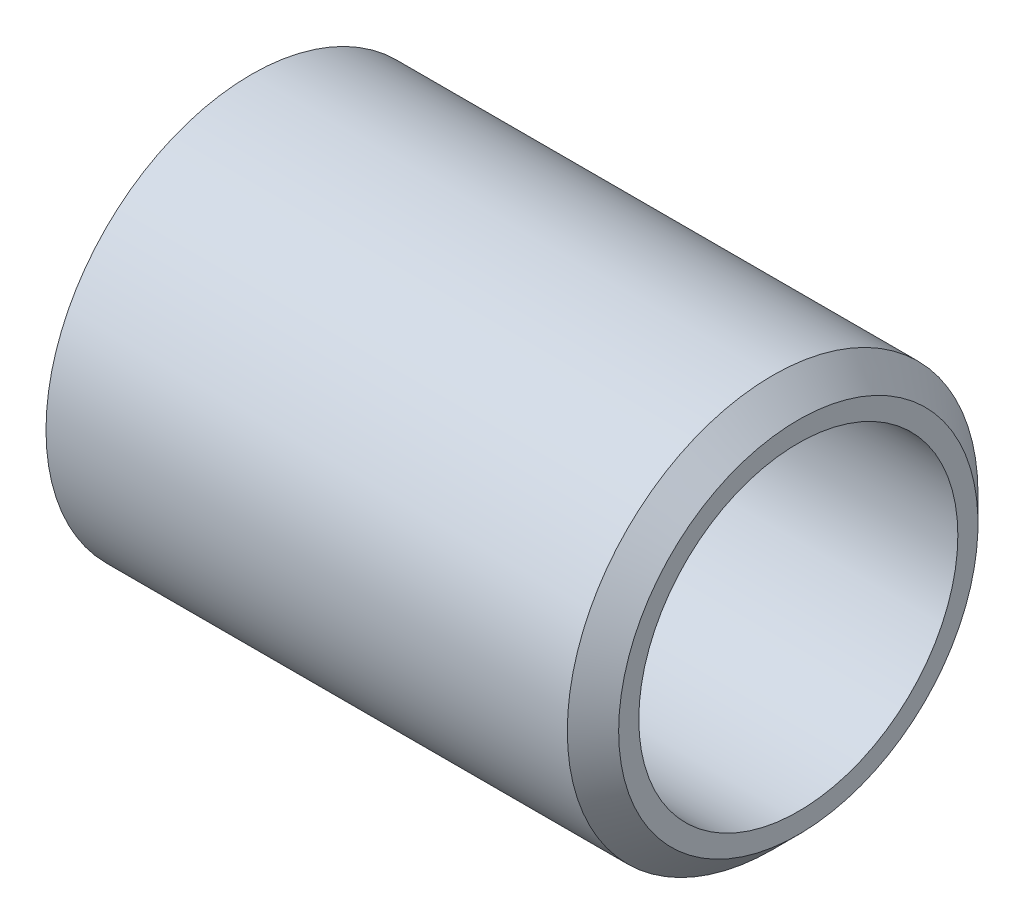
from build123d import *


with BuildPart() as part:
    # Sketch1 → BaseBody (revolve)
    with BuildSketch(Plane.XY, mode=Mode.PRIVATE) as basebody_sk:
        with BuildLine():
            Line((0, 24.6126), (0, 28.60675))
            Line((0, 28.60675), (72.62415625, 28.60675))
            Line((72.62415625, 28.60675), (76.2, 25.03090625))
            Line((76.2, 25.03090625), (76.2, 22.225))
            Line((76.2, 22.225), (2.3876, 22.225))
            ThreePointArc((2.3876, 22.225), (0.699311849, 22.924311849), (0, 24.6126))
        make_face()
    revolve(basebody_sk.sketch.rotate(Axis((0, 0, 0), (1, 0, 0)), 90), axis=Axis((0, 0, 0), (1, 0, 0)))


solid = part.part
